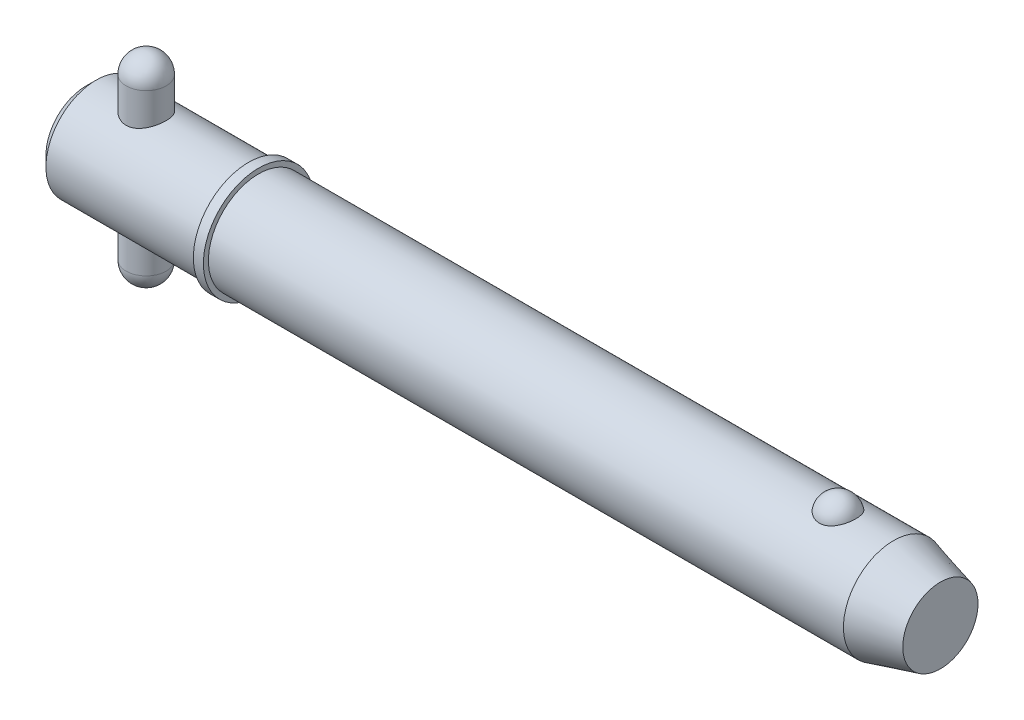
ISO-10303-21;
HEADER;
FILE_DESCRIPTION(('STEP AP214'),'2;1');
FILE_NAME('part.step','',(''),(''),'','','');
FILE_SCHEMA(('AUTOMOTIVE_DESIGN { 1 0 10303 214 1 1 1 1 }'));
ENDSEC;
DATA;
#1=APPLICATION_CONTEXT('core data for automotive mechanical design processes');
#2=APPLICATION_PROTOCOL_DEFINITION('international standard','automotive_design',2000,#1);
#3=PRODUCT_CONTEXT('',#1,'mechanical');
#4=PRODUCT('Part','Part','',(#3));
#5=PRODUCT_RELATED_PRODUCT_CATEGORY('part','',(#4));
#6=PRODUCT_DEFINITION_FORMATION('','',#4);
#7=PRODUCT_DEFINITION_CONTEXT('part definition',#1,'design');
#8=PRODUCT_DEFINITION('design','',#6,#7);
#9=PRODUCT_DEFINITION_SHAPE('','',#8);
#10=(LENGTH_UNIT() NAMED_UNIT(*) SI_UNIT(.MILLI.,.METRE.));
#11=(NAMED_UNIT(*) PLANE_ANGLE_UNIT() SI_UNIT($,.RADIAN.));
#12=(NAMED_UNIT(*) SI_UNIT($,.STERADIAN.) SOLID_ANGLE_UNIT());
#13=UNCERTAINTY_MEASURE_WITH_UNIT(LENGTH_MEASURE(1.E-05),#10,'distance_accuracy_value','');
#14=(GEOMETRIC_REPRESENTATION_CONTEXT(3) GLOBAL_UNCERTAINTY_ASSIGNED_CONTEXT((#13)) GLOBAL_UNIT_ASSIGNED_CONTEXT((#10,
#11,#12)) REPRESENTATION_CONTEXT('',''));
#15=CARTESIAN_POINT('',(0.,0.,0.));
#16=DIRECTION('',(0.,0.,1.));
#17=DIRECTION('',(1.,0.,0.));
#18=AXIS2_PLACEMENT_3D('',#15,#16,#17);
#19=CARTESIAN_POINT('',(9.525,15.875,0.));
#20=DIRECTION('',(0.,-1.,0.));
#21=DIRECTION('',(0.,0.,-1.));
#22=AXIS2_PLACEMENT_3D('',#19,#20,#21);
#23=CYLINDRICAL_SURFACE('',#22,3.175);
#24=CARTESIAN_POINT('',(9.525,-12.7,0.));
#25=DIRECTION('',(0.,-1.,0.));
#26=DIRECTION('',(0.,0.,-1.));
#27=AXIS2_PLACEMENT_3D('',#24,#25,#26);
#28=CIRCLE('',#27,3.175);
#29=CARTESIAN_POINT('',(9.525,-12.7,-3.175));
#30=VERTEX_POINT('',#29);
#31=EDGE_CURVE('P0_E10',#30,#30,#28,.F.);
#32=ORIENTED_EDGE('',*,*,#31,.T.);
#33=EDGE_LOOP('',(#32));
#34=FACE_BOUND('',#33,.T.);
#35=CARTESIAN_POINT('',(9.525,12.7,0.));
#36=DIRECTION('',(0.,-1.,0.));
#37=DIRECTION('',(0.,0.,-1.));
#38=AXIS2_PLACEMENT_3D('',#35,#36,#37);
#39=CIRCLE('',#38,3.175);
#40=CARTESIAN_POINT('',(9.525,12.7,-3.175));
#41=VERTEX_POINT('',#40);
#42=EDGE_CURVE('P0_E21',#41,#41,#39,.T.);
#43=ORIENTED_EDGE('',*,*,#42,.T.);
#44=EDGE_LOOP('',(#43));
#45=FACE_BOUND('',#44,.T.);
#46=ADVANCED_FACE('P0_F14',(#34,#45),#23,.T.);
#47=CARTESIAN_POINT('',(9.525,-12.7,0.));
#48=DIRECTION('',(0.,0.,1.));
#49=DIRECTION('',(1.,0.,0.));
#50=AXIS2_PLACEMENT_3D('',#47,#48,#49);
#51=SPHERICAL_SURFACE('',#50,3.175);
#52=CARTESIAN_POINT('',(9.525,-12.7,0.));
#53=DIRECTION('',(0.,-1.,0.));
#54=DIRECTION('',(0.,0.,-1.));
#55=AXIS2_PLACEMENT_3D('',#52,#53,#54);
#56=SPHERICAL_SURFACE('',#55,3.175);
#57=ORIENTED_EDGE('',*,*,#31,.F.);
#58=EDGE_LOOP('',(#57));
#59=FACE_BOUND('',#58,.T.);
#60=ADVANCED_FACE('P0_F29',(#59),#56,.T.);
#61=CARTESIAN_POINT('',(9.525,12.7,0.));
#62=DIRECTION('',(0.,0.,1.));
#63=DIRECTION('',(1.,0.,0.));
#64=AXIS2_PLACEMENT_3D('',#61,#62,#63);
#65=SPHERICAL_SURFACE('',#64,3.175);
#66=CARTESIAN_POINT('',(9.525,12.7,0.));
#67=DIRECTION('',(0.,-1.,0.));
#68=DIRECTION('',(0.,0.,-1.));
#69=AXIS2_PLACEMENT_3D('',#66,#67,#68);
#70=SPHERICAL_SURFACE('',#69,3.175);
#71=ORIENTED_EDGE('',*,*,#42,.F.);
#72=EDGE_LOOP('',(#71));
#73=FACE_BOUND('',#72,.T.);
#74=ADVANCED_FACE('P0_F16',(#73),#70,.T.);
#75=CLOSED_SHELL('',(#46,#60,#74));
#76=MANIFOLD_SOLID_BREP('P0_B1',#75);
#77=CARTESIAN_POINT('',(0.,0.,0.));
#78=DIRECTION('',(1.,0.,0.));
#79=DIRECTION('',(0.,0.,-1.));
#80=AXIS2_PLACEMENT_3D('',#77,#78,#79);
#81=CYLINDRICAL_SURFACE('',#80,7.94);
#82=CARTESIAN_POINT('',(127.851879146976,0.,0.));
#83=DIRECTION('',(1.,0.,0.));
#84=DIRECTION('',(0.,0.,-1.));
#85=AXIS2_PLACEMENT_3D('',#82,#83,#84);
#86=CIRCLE('',#85,7.94);
#87=CARTESIAN_POINT('',(127.851879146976,0.,-7.94));
#88=VERTEX_POINT('',#87);
#89=EDGE_CURVE('P1_E81',#88,#88,#86,.T.);
#90=ORIENTED_EDGE('',*,*,#89,.F.);
#91=EDGE_LOOP('',(#90));
#92=FACE_BOUND('',#91,.T.);
#93=CARTESIAN_POINT('',(27.31,0.,0.));
#94=DIRECTION('',(1.,0.,0.));
#95=DIRECTION('',(0.,0.,-1.));
#96=AXIS2_PLACEMENT_3D('',#93,#94,#95);
#97=CIRCLE('',#96,7.94);
#98=CARTESIAN_POINT('',(27.31,0.,-7.94));
#99=VERTEX_POINT('',#98);
#100=EDGE_CURVE('P1_E85',#99,#99,#97,.T.);
#101=ORIENTED_EDGE('',*,*,#100,.T.);
#102=EDGE_LOOP('',(#101));
#103=FACE_BOUND('',#102,.T.);
#104=CARTESIAN_POINT('',(119.044907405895,7.37767842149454,2.93486986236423));
#105=CARTESIAN_POINT('',(118.892749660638,7.3776732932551,2.93487505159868));
#106=CARTESIAN_POINT('',(118.740632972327,7.38258419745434,2.92262454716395));
#107=CARTESIAN_POINT('',(118.440928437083,7.40163229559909,2.87404196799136));
#108=CARTESIAN_POINT('',(118.293339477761,7.41576720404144,2.83771585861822));
#109=CARTESIAN_POINT('',(118.007018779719,7.4516157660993,2.74218769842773));
#110=CARTESIAN_POINT('',(117.868274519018,7.47331841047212,2.68301886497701));
#111=CARTESIAN_POINT('',(117.602882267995,7.52194082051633,2.54350967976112));
#112=CARTESIAN_POINT('',(117.476236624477,7.5488615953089,2.46316523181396));
#113=CARTESIAN_POINT('',(117.234534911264,7.60594671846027,2.28090375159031));
#114=CARTESIAN_POINT('',(117.119906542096,7.63618114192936,2.17844211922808));
#115=CARTESIAN_POINT('',(116.908878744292,7.69614046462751,1.95608495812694));
#116=CARTESIAN_POINT('',(116.812482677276,7.72586526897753,1.83618622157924));
#117=CARTESIAN_POINT('',(116.635938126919,7.78314821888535,1.57628086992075));
#118=CARTESIAN_POINT('',(116.556707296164,7.81055035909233,1.43561546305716));
#119=CARTESIAN_POINT('',(116.421797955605,7.85879631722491,1.14236334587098));
#120=CARTESIAN_POINT('',(116.366121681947,7.87963951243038,0.989775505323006));
#121=CARTESIAN_POINT('',(116.27881215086,7.91289645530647,0.67461992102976));
#122=CARTESIAN_POINT('',(116.24753090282,7.925186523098,0.511941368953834));
#123=CARTESIAN_POINT('',(116.210975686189,7.93958930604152,0.183247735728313));
#124=CARTESIAN_POINT('',(116.205701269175,7.94170219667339,0.0172327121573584));
#125=CARTESIAN_POINT('',(116.221231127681,7.93554931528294,-0.312672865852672));
#126=CARTESIAN_POINT('',(116.241925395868,7.92732732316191,-0.4765694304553));
#127=CARTESIAN_POINT('',(116.30878655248,7.90141534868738,-0.79830524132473));
#128=CARTESIAN_POINT('',(116.354953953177,7.88372517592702,-0.956144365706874));
#129=CARTESIAN_POINT('',(116.471898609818,7.84066230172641,-1.26152073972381));
#130=CARTESIAN_POINT('',(116.542704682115,7.81528060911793,-1.40904568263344));
#131=CARTESIAN_POINT('',(116.707478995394,7.7594867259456,-1.68950598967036));
#132=CARTESIAN_POINT('',(116.801448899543,7.72907417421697,-1.82244030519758));
#133=CARTESIAN_POINT('',(117.010839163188,7.66640424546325,-2.07032792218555));
#134=CARTESIAN_POINT('',(117.126315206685,7.63414223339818,-2.1852330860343));
#135=CARTESIAN_POINT('',(117.3759006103,7.57149681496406,-2.39329737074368));
#136=CARTESIAN_POINT('',(117.510008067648,7.54111321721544,-2.48645870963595));
#137=CARTESIAN_POINT('',(117.790111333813,7.48650742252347,-2.64628132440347));
#138=CARTESIAN_POINT('',(117.935760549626,7.46215900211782,-2.71350554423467));
#139=CARTESIAN_POINT('',(118.237425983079,7.42171253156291,-2.82226614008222));
#140=CARTESIAN_POINT('',(118.393438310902,7.40561140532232,-2.86381209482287));
#141=CARTESIAN_POINT('',(118.702970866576,7.3842679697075,-2.9183907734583));
#142=CARTESIAN_POINT('',(118.856222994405,7.37852109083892,-2.93275024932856));
#143=CARTESIAN_POINT('',(119.163070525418,7.37700973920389,-2.93655208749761));
#144=CARTESIAN_POINT('',(119.316665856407,7.38124333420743,-2.92599927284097));
#145=CARTESIAN_POINT('',(119.614990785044,7.39890635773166,-2.88102897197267));
#146=CARTESIAN_POINT('',(119.759848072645,7.41205491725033,-2.84733999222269));
#147=CARTESIAN_POINT('',(120.04164329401,7.445801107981,-2.75788206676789));
#148=CARTESIAN_POINT('',(120.178580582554,7.46639934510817,-2.70211132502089));
#149=CARTESIAN_POINT('',(120.444061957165,7.51339098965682,-2.56858908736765));
#150=CARTESIAN_POINT('',(120.572354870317,7.53990200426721,-2.4903806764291));
#151=CARTESIAN_POINT('',(120.814244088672,7.59569503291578,-2.31462737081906));
#152=CARTESIAN_POINT('',(120.927837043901,7.62497767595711,-2.21707808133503));
#153=CARTESIAN_POINT('',(121.14322156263,7.68489473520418,-1.99982049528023));
#154=CARTESIAN_POINT('',(121.244148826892,7.71552419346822,-1.87925337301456));
#155=CARTESIAN_POINT('',(121.425186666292,7.77353016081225,-1.62268826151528));
#156=CARTESIAN_POINT('',(121.505293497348,7.80090608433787,-1.4866875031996));
#157=CARTESIAN_POINT('',(121.645361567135,7.85047992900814,-1.19818413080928));
#158=CARTESIAN_POINT('',(121.704587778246,7.8724818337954,-1.04529016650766));
#159=CARTESIAN_POINT('',(121.797982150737,7.90785114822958,-0.731080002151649));
#160=CARTESIAN_POINT('',(121.832149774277,7.92121837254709,-0.569763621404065));
#161=CARTESIAN_POINT('',(121.874795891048,7.93797834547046,-0.242812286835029));
#162=CARTESIAN_POINT('',(121.883204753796,7.94134405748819,-0.0771668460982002));
#163=CARTESIAN_POINT('',(121.873962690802,7.93767937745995,0.2532769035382));
#164=CARTESIAN_POINT('',(121.856312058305,7.93064910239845,0.418075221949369));
#165=CARTESIAN_POINT('',(121.795424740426,7.90695571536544,0.74152553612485));
#166=CARTESIAN_POINT('',(121.752281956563,7.8903279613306,0.900197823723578));
#167=CARTESIAN_POINT('',(121.64135358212,7.84916386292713,1.20759654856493));
#168=CARTESIAN_POINT('',(121.57356656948,7.82462706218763,1.35632241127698));
#169=CARTESIAN_POINT('',(121.414371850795,7.7700669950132,1.64032869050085));
#170=CARTESIAN_POINT('',(121.322861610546,7.7400200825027,1.77554712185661));
#171=CARTESIAN_POINT('',(121.118296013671,7.67774175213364,2.02800648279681));
#172=CARTESIAN_POINT('',(121.005241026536,7.64551037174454,2.14524772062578));
#173=CARTESIAN_POINT('',(120.760831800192,7.58265895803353,2.35778002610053));
#174=CARTESIAN_POINT('',(120.629583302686,7.5520309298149,2.45319004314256));
#175=CARTESIAN_POINT('',(120.351601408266,7.49579792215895,2.61999897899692));
#176=CARTESIAN_POINT('',(120.204867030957,7.47019326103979,2.69139637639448));
#177=CARTESIAN_POINT('',(119.892947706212,7.42622216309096,2.8105324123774));
#178=CARTESIAN_POINT('',(119.727220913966,7.40825002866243,2.85700910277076));
#179=CARTESIAN_POINT('',(119.389279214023,7.38398348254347,2.9191685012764));
#180=CARTESIAN_POINT('',(119.21706702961,7.3776842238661,2.93486399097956));
#181=CARTESIAN_POINT('',(119.044907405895,7.37767842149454,2.93486986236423));
#182=B_SPLINE_CURVE_WITH_KNOTS('',3,(#104,#105,#106,#107,#108,#109,#110,#111,#112,#113,#114,
#115,#116,#117,#118,#119,#120,#121,#122,#123,#124,#125,#126,#127,#128,#129,#130,#131,#132,#133,
#134,#135,#136,#137,#138,#139,#140,#141,#142,#143,#144,#145,#146,#147,#148,#149,#150,#151,#152,
#153,#154,#155,#156,#157,#158,#159,#160,#161,#162,#163,#164,#165,#166,#167,#168,#169,#170,#171,
#172,#173,#174,#175,#176,#177,#178,#179,#180,#181),.UNSPECIFIED.,.T.,.F.,(4,2,2,2,2,2,2,2,2,2,2,
2,2,2,2,2,2,2,2,2,2,2,2,2,2,2,2,2,2,2,2,2,2,2,2,2,2,2,4),(0.,0.45584132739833,0.911569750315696,
1.36663794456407,1.8217942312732,2.28978983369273,2.7578716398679,3.246853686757,
3.73588214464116,4.23184282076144,4.72779494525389,5.22165321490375,5.71552141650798,
6.20996917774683,6.70445245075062,7.20023431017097,7.69596557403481,8.18023418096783,
8.66432203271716,9.12410697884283,9.58380291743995,10.0296503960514,10.4755341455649,
10.9312349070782,11.3870393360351,11.8654416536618,12.3439299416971,12.8378875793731,
13.3318558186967,13.8271581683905,14.3224549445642,14.8159385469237,15.3094506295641,
15.8051323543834,16.3008055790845,16.7937101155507,17.2866458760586,17.8026240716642,
18.3183879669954),.UNSPECIFIED.);
#183=CARTESIAN_POINT('',(119.044907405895,7.37767842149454,2.93486986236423));
#184=VERTEX_POINT('',#183);
#185=EDGE_CURVE('P1_E35',#184,#184,#182,.T.);
#186=ORIENTED_EDGE('',*,*,#185,.T.);
#187=EDGE_LOOP('',(#186));
#188=FACE_BOUND('',#187,.T.);
#189=ADVANCED_FACE('P1_F13',(#92,#103,#188),#81,.T.);
#190=CARTESIAN_POINT('',(0.,0.,0.));
#191=DIRECTION('',(-1.,0.,0.));
#192=DIRECTION('',(0.,0.,1.));
#193=AXIS2_PLACEMENT_3D('',#190,#191,#192);
#194=PLANE('',#193);
#195=CARTESIAN_POINT('',(0.,0.,0.));
#196=DIRECTION('',(1.,0.,0.));
#197=DIRECTION('',(0.,0.,-1.));
#198=AXIS2_PLACEMENT_3D('',#195,#196,#197);
#199=CIRCLE('',#198,6.352);
#200=CARTESIAN_POINT('',(0.,0.,-6.352));
#201=VERTEX_POINT('',#200);
#202=EDGE_CURVE('P1_E9',#201,#201,#199,.T.);
#203=ORIENTED_EDGE('',*,*,#202,.F.);
#204=EDGE_LOOP('',(#203));
#205=FACE_BOUND('',#204,.T.);
#206=ADVANCED_FACE('P1_F15',(#205),#194,.T.);
#207=CARTESIAN_POINT('',(1.58799999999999,0.,0.));
#208=DIRECTION('',(1.,0.,0.));
#209=DIRECTION('',(0.,0.,-1.));
#210=AXIS2_PLACEMENT_3D('',#207,#208,#209);
#211=CONICAL_SURFACE('',#210,7.94,0.78539816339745);
#212=ORIENTED_EDGE('',*,*,#202,.T.);
#213=EDGE_LOOP('',(#212));
#214=FACE_BOUND('',#213,.T.);
#215=CARTESIAN_POINT('',(1.58799999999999,0.,0.));
#216=DIRECTION('',(1.,0.,0.));
#217=DIRECTION('',(0.,0.,-1.));
#218=AXIS2_PLACEMENT_3D('',#215,#216,#217);
#219=CIRCLE('',#218,7.94);
#220=CARTESIAN_POINT('',(1.58799999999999,0.,-7.94));
#221=VERTEX_POINT('',#220);
#222=EDGE_CURVE('P1_E26',#221,#221,#219,.T.);
#223=ORIENTED_EDGE('',*,*,#222,.F.);
#224=EDGE_LOOP('',(#223));
#225=FACE_BOUND('',#224,.T.);
#226=ADVANCED_FACE('P1_F77',(#214,#225),#211,.T.);
#227=CARTESIAN_POINT('',(0.,0.,0.));
#228=DIRECTION('',(1.,0.,0.));
#229=DIRECTION('',(0.,0.,-1.));
#230=AXIS2_PLACEMENT_3D('',#227,#228,#229);
#231=CYLINDRICAL_SURFACE('',#230,7.94);
#232=CARTESIAN_POINT('',(9.525,-7.27756655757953,3.175));
#233=CARTESIAN_POINT('',(9.43992346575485,-7.27756715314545,3.17499935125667));
#234=CARTESIAN_POINT('',(9.35481882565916,-7.27906496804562,3.1715736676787));
#235=CARTESIAN_POINT('',(9.18524505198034,-7.28499816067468,3.15791803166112));
#236=CARTESIAN_POINT('',(9.100776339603,-7.28943533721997,3.14768391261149));
#237=CARTESIAN_POINT('',(8.84895715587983,-7.30698881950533,3.10684226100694));
#238=CARTESIAN_POINT('',(8.6834173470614,-7.32434654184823,3.06609574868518));
#239=CARTESIAN_POINT('',(8.36278910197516,-7.36806950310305,2.95945910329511));
#240=CARTESIAN_POINT('',(8.20766386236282,-7.39440078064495,2.89366366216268));
#241=CARTESIAN_POINT('',(7.91065319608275,-7.45304562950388,2.73907413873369));
#242=CARTESIAN_POINT('',(7.76876488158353,-7.48535789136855,2.65028508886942));
#243=CARTESIAN_POINT('',(7.49411086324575,-7.55439482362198,2.44679888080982));
#244=CARTESIAN_POINT('',(7.36219910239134,-7.59126138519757,2.33099745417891));
#245=CARTESIAN_POINT('',(7.11904234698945,-7.66408045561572,2.07909838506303));
#246=CARTESIAN_POINT('',(7.00780457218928,-7.70003264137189,1.94299368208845));
#247=CARTESIAN_POINT('',(6.80492173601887,-7.76867514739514,1.64775981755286));
#248=CARTESIAN_POINT('',(6.71422139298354,-7.80118112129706,1.48793473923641));
#249=CARTESIAN_POINT('',(6.56135788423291,-7.85754918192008,1.15376269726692));
#250=CARTESIAN_POINT('',(6.49918311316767,-7.88141478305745,0.979421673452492));
#251=CARTESIAN_POINT('',(6.40818142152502,-7.91680873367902,0.630115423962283));
#252=CARTESIAN_POINT('',(6.3778864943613,-7.9288781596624,0.455588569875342));
#253=CARTESIAN_POINT('',(6.34677743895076,-7.94127547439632,0.103539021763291));
#254=CARTESIAN_POINT('',(6.34595232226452,-7.94160773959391,-0.0739825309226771));
#255=CARTESIAN_POINT('',(6.37300128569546,-7.93082261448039,-0.416371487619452));
#256=CARTESIAN_POINT('',(6.39926693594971,-7.92034690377,-0.581389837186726));
#257=CARTESIAN_POINT('',(6.47701615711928,-7.88998770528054,-0.904449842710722));
#258=CARTESIAN_POINT('',(6.52850157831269,-7.87010352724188,-1.06249098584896));
#259=CARTESIAN_POINT('',(6.65586120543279,-7.82249343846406,-1.36995769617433));
#260=CARTESIAN_POINT('',(6.73209124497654,-7.79465387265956,-1.51921754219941));
#261=CARTESIAN_POINT('',(6.90644286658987,-7.73389606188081,-1.80321183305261));
#262=CARTESIAN_POINT('',(7.00457194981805,-7.70097607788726,-1.93794127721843));
#263=CARTESIAN_POINT('',(7.22744086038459,-7.63084889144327,-2.19843606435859));
#264=CARTESIAN_POINT('',(7.35350432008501,-7.59350211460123,-2.3230330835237));
#265=CARTESIAN_POINT('',(7.62488266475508,-7.52039654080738,-2.54979642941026));
#266=CARTESIAN_POINT('',(7.77020381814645,-7.48463826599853,-2.65195542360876));
#267=CARTESIAN_POINT('',(8.08119298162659,-7.41780943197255,-2.83361305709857));
#268=CARTESIAN_POINT('',(8.24731937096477,-7.38689959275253,-2.91239105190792));
#269=CARTESIAN_POINT('',(8.59204539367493,-7.33515216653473,-3.04038913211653));
#270=CARTESIAN_POINT('',(8.77063684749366,-7.31430804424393,-3.08962840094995));
#271=CARTESIAN_POINT('',(9.12356982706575,-7.28663831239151,-3.15431018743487));
#272=CARTESIAN_POINT('',(9.29750494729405,-7.2790344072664,-3.17163284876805));
#273=CARTESIAN_POINT('',(9.64592502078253,-7.27648884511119,-3.17747282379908));
#274=CARTESIAN_POINT('',(9.82040979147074,-7.28154335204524,-3.16599886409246));
#275=CARTESIAN_POINT('',(10.1545374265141,-7.30294638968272,-3.11628310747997));
#276=CARTESIAN_POINT('',(10.3144598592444,-7.31863587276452,-3.0796016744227));
#277=CARTESIAN_POINT('',(10.625774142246,-7.35872371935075,-2.98253618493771));
#278=CARTESIAN_POINT('',(10.7771640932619,-7.38312401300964,-2.92214687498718));
#279=CARTESIAN_POINT('',(11.0739599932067,-7.4390944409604,-2.77664664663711));
#280=CARTESIAN_POINT('',(11.2188745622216,-7.47091513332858,-2.69063278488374));
#281=CARTESIAN_POINT('',(11.4928722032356,-7.53775867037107,-2.49724834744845));
#282=CARTESIAN_POINT('',(11.6219487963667,-7.57278281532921,-2.38986907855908));
#283=CARTESIAN_POINT('',(11.8705091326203,-7.64520845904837,-2.1474449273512));
#284=CARTESIAN_POINT('',(11.9885816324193,-7.68259462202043,-2.01094304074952));
#285=CARTESIAN_POINT('',(12.2003631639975,-7.75309951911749,-1.71917041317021));
#286=CARTESIAN_POINT('',(12.2940712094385,-7.78621808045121,-1.56389891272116));
#287=CARTESIAN_POINT('',(12.4541161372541,-7.84456050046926,-1.23845027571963));
#288=CARTESIAN_POINT('',(12.5204600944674,-7.86978639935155,-1.06827700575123));
#289=CARTESIAN_POINT('',(12.6231407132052,-7.90943635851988,-0.717928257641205));
#290=CARTESIAN_POINT('',(12.6594936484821,-7.92386627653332,-0.537758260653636));
#291=CARTESIAN_POINT('',(12.6992281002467,-7.93967263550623,-0.185201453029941));
#292=CARTESIAN_POINT('',(12.7046050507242,-7.94183891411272,-0.0130732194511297));
#293=CARTESIAN_POINT('',(12.6875036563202,-7.9350072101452,0.329549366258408));
#294=CARTESIAN_POINT('',(12.6650295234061,-7.92601091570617,0.500043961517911));
#295=CARTESIAN_POINT('',(12.5942896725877,-7.89825976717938,0.829196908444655));
#296=CARTESIAN_POINT('',(12.5468364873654,-7.87981280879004,0.988057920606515));
#297=CARTESIAN_POINT('',(12.4283390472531,-7.83513565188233,1.29553461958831));
#298=CARTESIAN_POINT('',(12.3572904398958,-7.8089040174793,1.44414841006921));
#299=CARTESIAN_POINT('',(12.1900822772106,-7.7497911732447,1.73412879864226));
#300=CARTESIAN_POINT('',(12.0929519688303,-7.71666737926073,1.87488510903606));
#301=CARTESIAN_POINT('',(11.8777894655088,-7.64775894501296,2.13869231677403));
#302=CARTESIAN_POINT('',(11.7597486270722,-7.61197320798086,2.26173585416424));
#303=CARTESIAN_POINT('',(11.4974896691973,-7.53902341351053,2.49449755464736));
#304=CARTESIAN_POINT('',(11.3521039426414,-7.50191102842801,2.60292060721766));
#305=CARTESIAN_POINT('',(11.0440201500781,-7.43289551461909,2.79392602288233));
#306=CARTESIAN_POINT('',(10.8813200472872,-7.40099299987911,2.87650534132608));
#307=CARTESIAN_POINT('',(10.558064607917,-7.3489506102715,3.00682739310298));
#308=CARTESIAN_POINT('',(10.398627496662,-7.32801197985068,3.05703164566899));
#309=CARTESIAN_POINT('',(10.0731242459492,-7.29639491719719,3.13175843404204));
#310=CARTESIAN_POINT('',(9.90707793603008,-7.28568789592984,3.15635254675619));
#311=CARTESIAN_POINT('',(9.70441566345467,-7.27968826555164,3.17013149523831));
#312=CARTESIAN_POINT('',(9.66856669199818,-7.27889378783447,3.17195593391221));
#313=CARTESIAN_POINT('',(9.59681348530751,-7.27783278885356,3.17439036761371));
#314=CARTESIAN_POINT('',(9.56090924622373,-7.27756630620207,3.17500027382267));
#315=CARTESIAN_POINT('',(9.525,-7.27756655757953,3.175));
#316=B_SPLINE_CURVE_WITH_KNOTS('',3,(#232,#233,#234,#235,#236,#237,#238,#239,#240,#241,#242,
#243,#244,#245,#246,#247,#248,#249,#250,#251,#252,#253,#254,#255,#256,#257,#258,#259,#260,#261,
#262,#263,#264,#265,#266,#267,#268,#269,#270,#271,#272,#273,#274,#275,#276,#277,#278,#279,#280,
#281,#282,#283,#284,#285,#286,#287,#288,#289,#290,#291,#292,#293,#294,#295,#296,#297,#298,#299,
#300,#301,#302,#303,#304,#305,#306,#307,#308,#309,#310,#311,#312,#313,#314,#315),.UNSPECIFIED.,
.T.,.F.,(4,2,2,2,2,2,2,2,2,2,2,2,2,2,2,2,2,2,2,2,2,2,2,2,2,2,2,2,2,2,2,2,2,2,2,2,2,2,2,2,2,4),
(0.,0.255187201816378,0.510530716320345,1.0218798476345,1.53131482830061,2.04063840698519,
2.57635929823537,3.11226692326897,3.66929090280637,4.22608806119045,4.75594400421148,
5.28560237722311,5.78552836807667,6.28549104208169,6.79298787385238,7.30065880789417,
7.8416422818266,8.38280228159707,8.93923025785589,9.49529647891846,10.0174074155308,
10.5393601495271,11.0316114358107,11.5239718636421,12.0362920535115,12.5488211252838,
13.0991799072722,13.6495609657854,14.1997996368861,14.7497395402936,15.2638187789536,
15.7778202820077,16.2760504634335,16.7743726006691,17.294711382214,17.8152657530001,
18.3680208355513,18.9208410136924,19.4240423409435,19.9258334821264,20.0335354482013,
20.1412452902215),.UNSPECIFIED.);
#317=CARTESIAN_POINT('',(9.525,-7.27756655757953,3.175));
#318=VERTEX_POINT('',#317);
#319=EDGE_CURVE('P1_E17',#318,#318,#316,.T.);
#320=ORIENTED_EDGE('',*,*,#319,.F.);
#321=EDGE_LOOP('',(#320));
#322=FACE_BOUND('',#321,.T.);
#323=CARTESIAN_POINT('',(9.525,7.27756655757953,3.175));
#324=CARTESIAN_POINT('',(9.61007653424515,7.27756715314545,3.17499935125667));
#325=CARTESIAN_POINT('',(9.69518117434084,7.27906496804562,3.1715736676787));
#326=CARTESIAN_POINT('',(9.86475494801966,7.28499816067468,3.15791803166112));
#327=CARTESIAN_POINT('',(9.949223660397,7.28943533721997,3.14768391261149));
#328=CARTESIAN_POINT('',(10.2010428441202,7.30698881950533,3.10684226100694));
#329=CARTESIAN_POINT('',(10.3665826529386,7.32434654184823,3.06609574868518));
#330=CARTESIAN_POINT('',(10.6872108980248,7.36806950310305,2.95945910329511));
#331=CARTESIAN_POINT('',(10.8423361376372,7.39440078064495,2.89366366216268));
#332=CARTESIAN_POINT('',(11.1393468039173,7.45304562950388,2.73907413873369));
#333=CARTESIAN_POINT('',(11.2812351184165,7.48535789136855,2.65028508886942));
#334=CARTESIAN_POINT('',(11.5558891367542,7.55439482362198,2.44679888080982));
#335=CARTESIAN_POINT('',(11.6878008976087,7.59126138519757,2.33099745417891));
#336=CARTESIAN_POINT('',(11.9309576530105,7.66408045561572,2.07909838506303));
#337=CARTESIAN_POINT('',(12.0421954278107,7.70003264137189,1.94299368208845));
#338=CARTESIAN_POINT('',(12.2450782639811,7.76867514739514,1.64775981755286));
#339=CARTESIAN_POINT('',(12.3357786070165,7.80118112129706,1.48793473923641));
#340=CARTESIAN_POINT('',(12.4886421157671,7.85754918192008,1.15376269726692));
#341=CARTESIAN_POINT('',(12.5508168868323,7.88141478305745,0.979421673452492));
#342=CARTESIAN_POINT('',(12.641818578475,7.91680873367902,0.630115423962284));
#343=CARTESIAN_POINT('',(12.6721135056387,7.9288781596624,0.455588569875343));
#344=CARTESIAN_POINT('',(12.7032225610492,7.94127547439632,0.103539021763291));
#345=CARTESIAN_POINT('',(12.7040476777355,7.94160773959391,-0.0739825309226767));
#346=CARTESIAN_POINT('',(12.6769987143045,7.93082261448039,-0.416371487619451));
#347=CARTESIAN_POINT('',(12.6507330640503,7.92034690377,-0.581389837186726));
#348=CARTESIAN_POINT('',(12.5729838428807,7.88998770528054,-0.904449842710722));
#349=CARTESIAN_POINT('',(12.5214984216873,7.87010352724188,-1.06249098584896));
#350=CARTESIAN_POINT('',(12.3941387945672,7.82249343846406,-1.36995769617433));
#351=CARTESIAN_POINT('',(12.3179087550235,7.79465387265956,-1.51921754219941));
#352=CARTESIAN_POINT('',(12.1435571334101,7.73389606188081,-1.80321183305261));
#353=CARTESIAN_POINT('',(12.0454280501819,7.70097607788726,-1.93794127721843));
#354=CARTESIAN_POINT('',(11.8225591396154,7.63084889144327,-2.19843606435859));
#355=CARTESIAN_POINT('',(11.696495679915,7.59350211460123,-2.3230330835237));
#356=CARTESIAN_POINT('',(11.4251173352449,7.52039654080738,-2.54979642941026));
#357=CARTESIAN_POINT('',(11.2797961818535,7.48463826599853,-2.65195542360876));
#358=CARTESIAN_POINT('',(10.9688070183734,7.41780943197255,-2.83361305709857));
#359=CARTESIAN_POINT('',(10.8026806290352,7.38689959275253,-2.91239105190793));
#360=CARTESIAN_POINT('',(10.4579546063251,7.33515216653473,-3.04038913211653));
#361=CARTESIAN_POINT('',(10.2793631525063,7.31430804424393,-3.08962840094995));
#362=CARTESIAN_POINT('',(9.92643017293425,7.28663831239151,-3.15431018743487));
#363=CARTESIAN_POINT('',(9.75249505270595,7.2790344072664,-3.17163284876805));
#364=CARTESIAN_POINT('',(9.40407497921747,7.2764888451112,-3.17747282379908));
#365=CARTESIAN_POINT('',(9.22959020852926,7.28154335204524,-3.16599886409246));
#366=CARTESIAN_POINT('',(8.89546257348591,7.30294638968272,-3.11628310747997));
#367=CARTESIAN_POINT('',(8.73554014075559,7.31863587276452,-3.0796016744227));
#368=CARTESIAN_POINT('',(8.42422585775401,7.35872371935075,-2.98253618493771));
#369=CARTESIAN_POINT('',(8.27283590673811,7.38312401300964,-2.92214687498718));
#370=CARTESIAN_POINT('',(7.97604000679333,7.4390944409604,-2.77664664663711));
#371=CARTESIAN_POINT('',(7.83112543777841,7.47091513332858,-2.69063278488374));
#372=CARTESIAN_POINT('',(7.55712779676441,7.53775867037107,-2.49724834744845));
#373=CARTESIAN_POINT('',(7.42805120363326,7.57278281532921,-2.38986907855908));
#374=CARTESIAN_POINT('',(7.17949086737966,7.64520845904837,-2.1474449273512));
#375=CARTESIAN_POINT('',(7.06141836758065,7.68259462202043,-2.01094304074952));
#376=CARTESIAN_POINT('',(6.8496368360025,7.75309951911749,-1.71917041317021));
#377=CARTESIAN_POINT('',(6.75592879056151,7.78621808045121,-1.56389891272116));
#378=CARTESIAN_POINT('',(6.59588386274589,7.84456050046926,-1.23845027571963));
#379=CARTESIAN_POINT('',(6.52953990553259,7.86978639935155,-1.06827700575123));
#380=CARTESIAN_POINT('',(6.42685928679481,7.90943635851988,-0.717928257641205));
#381=CARTESIAN_POINT('',(6.39050635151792,7.92386627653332,-0.537758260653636));
#382=CARTESIAN_POINT('',(6.35077189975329,7.93967263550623,-0.18520145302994));
#383=CARTESIAN_POINT('',(6.34539494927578,7.94183891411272,-0.0130732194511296));
#384=CARTESIAN_POINT('',(6.36249634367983,7.9350072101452,0.329549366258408));
#385=CARTESIAN_POINT('',(6.38497047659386,7.92601091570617,0.500043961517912));
#386=CARTESIAN_POINT('',(6.45571032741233,7.89825976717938,0.829196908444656));
#387=CARTESIAN_POINT('',(6.50316351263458,7.87981280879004,0.988057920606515));
#388=CARTESIAN_POINT('',(6.62166095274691,7.83513565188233,1.29553461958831));
#389=CARTESIAN_POINT('',(6.69270956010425,7.8089040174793,1.44414841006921));
#390=CARTESIAN_POINT('',(6.85991772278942,7.7497911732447,1.73412879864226));
#391=CARTESIAN_POINT('',(6.95704803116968,7.71666737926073,1.87488510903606));
#392=CARTESIAN_POINT('',(7.17221053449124,7.64775894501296,2.13869231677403));
#393=CARTESIAN_POINT('',(7.29025137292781,7.61197320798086,2.26173585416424));
#394=CARTESIAN_POINT('',(7.55251033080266,7.53902341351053,2.49449755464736));
#395=CARTESIAN_POINT('',(7.69789605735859,7.50191102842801,2.60292060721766));
#396=CARTESIAN_POINT('',(8.00597984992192,7.43289551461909,2.79392602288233));
#397=CARTESIAN_POINT('',(8.16867995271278,7.40099299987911,2.87650534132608));
#398=CARTESIAN_POINT('',(8.49193539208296,7.3489506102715,3.00682739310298));
#399=CARTESIAN_POINT('',(8.65137250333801,7.32801197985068,3.05703164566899));
#400=CARTESIAN_POINT('',(8.97687575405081,7.29639491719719,3.13175843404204));
#401=CARTESIAN_POINT('',(9.14292206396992,7.28568789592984,3.15635254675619));
#402=CARTESIAN_POINT('',(9.34558433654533,7.27968826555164,3.17013149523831));
#403=CARTESIAN_POINT('',(9.38143330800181,7.27889378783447,3.17195593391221));
#404=CARTESIAN_POINT('',(9.45318651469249,7.27783278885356,3.17439036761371));
#405=CARTESIAN_POINT('',(9.48909075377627,7.27756630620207,3.17500027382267));
#406=CARTESIAN_POINT('',(9.525,7.27756655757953,3.175));
#407=B_SPLINE_CURVE_WITH_KNOTS('',3,(#323,#324,#325,#326,#327,#328,#329,#330,#331,#332,#333,
#334,#335,#336,#337,#338,#339,#340,#341,#342,#343,#344,#345,#346,#347,#348,#349,#350,#351,#352,
#353,#354,#355,#356,#357,#358,#359,#360,#361,#362,#363,#364,#365,#366,#367,#368,#369,#370,#371,
#372,#373,#374,#375,#376,#377,#378,#379,#380,#381,#382,#383,#384,#385,#386,#387,#388,#389,#390,
#391,#392,#393,#394,#395,#396,#397,#398,#399,#400,#401,#402,#403,#404,#405,#406),.UNSPECIFIED.,
.T.,.F.,(4,2,2,2,2,2,2,2,2,2,2,2,2,2,2,2,2,2,2,2,2,2,2,2,2,2,2,2,2,2,2,2,2,2,2,2,2,2,2,2,2,4),
(0.,0.255187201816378,0.510530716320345,1.0218798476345,1.53131482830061,2.04063840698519,
2.57635929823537,3.11226692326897,3.66929090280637,4.22608806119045,4.75594400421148,
5.2856023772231,5.78552836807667,6.28549104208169,6.79298787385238,7.30065880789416,
7.8416422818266,8.38280228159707,8.9392302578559,9.49529647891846,10.0174074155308,
10.5393601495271,11.0316114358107,11.5239718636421,12.0362920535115,12.5488211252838,
13.0991799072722,13.6495609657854,14.1997996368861,14.7497395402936,15.2638187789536,
15.7778202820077,16.2760504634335,16.7743726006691,17.294711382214,17.8152657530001,
18.3680208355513,18.9208410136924,19.4240423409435,19.9258334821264,20.0335354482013,
20.1412452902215),.UNSPECIFIED.);
#408=CARTESIAN_POINT('',(9.525,7.27756655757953,3.175));
#409=VERTEX_POINT('',#408);
#410=EDGE_CURVE('P1_E43',#409,#409,#407,.T.);
#411=ORIENTED_EDGE('',*,*,#410,.F.);
#412=EDGE_LOOP('',(#411));
#413=FACE_BOUND('',#412,.T.);
#414=ORIENTED_EDGE('',*,*,#222,.T.);
#415=EDGE_LOOP('',(#414));
#416=FACE_BOUND('',#415,.T.);
#417=CARTESIAN_POINT('',(25.722,0.,0.));
#418=DIRECTION('',(1.,0.,0.));
#419=DIRECTION('',(0.,0.,-1.));
#420=AXIS2_PLACEMENT_3D('',#417,#418,#419);
#421=CIRCLE('',#420,7.94);
#422=CARTESIAN_POINT('',(25.722,0.,-7.94));
#423=VERTEX_POINT('',#422);
#424=EDGE_CURVE('P1_E31',#423,#423,#421,.T.);
#425=ORIENTED_EDGE('',*,*,#424,.F.);
#426=EDGE_LOOP('',(#425));
#427=FACE_BOUND('',#426,.T.);
#428=ADVANCED_FACE('P1_F103',(#322,#413,#416,#427),#231,.T.);
#429=CARTESIAN_POINT('',(25.722,7.94,0.));
#430=DIRECTION('',(-1.,0.,0.));
#431=DIRECTION('',(0.,0.,1.));
#432=AXIS2_PLACEMENT_3D('',#429,#430,#431);
#433=PLANE('',#432);
#434=ORIENTED_EDGE('',*,*,#424,.T.);
#435=EDGE_LOOP('',(#434));
#436=FACE_BOUND('',#435,.T.);
#437=CARTESIAN_POINT('',(25.722,0.,0.));
#438=DIRECTION('',(1.,0.,0.));
#439=DIRECTION('',(0.,0.,-1.));
#440=AXIS2_PLACEMENT_3D('',#437,#438,#439);
#441=CIRCLE('',#440,8.734);
#442=CARTESIAN_POINT('',(25.722,0.,-8.734));
#443=VERTEX_POINT('',#442);
#444=EDGE_CURVE('P1_E91',#443,#443,#441,.T.);
#445=ORIENTED_EDGE('',*,*,#444,.F.);
#446=EDGE_LOOP('',(#445));
#447=FACE_BOUND('',#446,.T.);
#448=ADVANCED_FACE('P1_F100',(#436,#447),#433,.T.);
#449=CARTESIAN_POINT('',(0.,0.,0.));
#450=DIRECTION('',(1.,0.,0.));
#451=DIRECTION('',(0.,0.,-1.));
#452=AXIS2_PLACEMENT_3D('',#449,#450,#451);
#453=CYLINDRICAL_SURFACE('',#452,8.734);
#454=ORIENTED_EDGE('',*,*,#444,.T.);
#455=EDGE_LOOP('',(#454));
#456=FACE_BOUND('',#455,.T.);
#457=CARTESIAN_POINT('',(27.31,0.,0.));
#458=DIRECTION('',(1.,0.,0.));
#459=DIRECTION('',(0.,0.,-1.));
#460=AXIS2_PLACEMENT_3D('',#457,#458,#459);
#461=CIRCLE('',#460,8.734);
#462=CARTESIAN_POINT('',(27.31,0.,-8.734));
#463=VERTEX_POINT('',#462);
#464=EDGE_CURVE('P1_E88',#463,#463,#461,.T.);
#465=ORIENTED_EDGE('',*,*,#464,.F.);
#466=EDGE_LOOP('',(#465));
#467=FACE_BOUND('',#466,.T.);
#468=ADVANCED_FACE('P1_F68',(#456,#467),#453,.T.);
#469=CARTESIAN_POINT('',(27.31,8.734,0.));
#470=DIRECTION('',(1.,0.,0.));
#471=DIRECTION('',(0.,0.,-1.));
#472=AXIS2_PLACEMENT_3D('',#469,#470,#471);
#473=PLANE('',#472);
#474=ORIENTED_EDGE('',*,*,#464,.T.);
#475=EDGE_LOOP('',(#474));
#476=FACE_BOUND('',#475,.T.);
#477=ORIENTED_EDGE('',*,*,#100,.F.);
#478=EDGE_LOOP('',(#477));
#479=FACE_BOUND('',#478,.T.);
#480=ADVANCED_FACE('P1_F62',(#476,#479),#473,.T.);
#481=CARTESIAN_POINT('',(135.26,0.,0.));
#482=DIRECTION('',(-1.,0.,0.));
#483=DIRECTION('',(0.,0.,1.));
#484=AXIS2_PLACEMENT_3D('',#481,#482,#483);
#485=CONICAL_SURFACE('',#484,5.95500000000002,0.261799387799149);
#486=ORIENTED_EDGE('',*,*,#89,.T.);
#487=EDGE_LOOP('',(#486));
#488=FACE_BOUND('',#487,.T.);
#489=CARTESIAN_POINT('',(135.26,0.,0.));
#490=DIRECTION('',(1.,0.,0.));
#491=DIRECTION('',(0.,0.,-1.));
#492=AXIS2_PLACEMENT_3D('',#489,#490,#491);
#493=CIRCLE('',#492,5.95500000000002);
#494=CARTESIAN_POINT('',(135.26,0.,-5.95500000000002));
#495=VERTEX_POINT('',#494);
#496=EDGE_CURVE('P1_E42',#495,#495,#493,.T.);
#497=ORIENTED_EDGE('',*,*,#496,.F.);
#498=EDGE_LOOP('',(#497));
#499=FACE_BOUND('',#498,.T.);
#500=ADVANCED_FACE('P1_F59',(#488,#499),#485,.T.);
#501=CARTESIAN_POINT('',(135.26,5.95500000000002,0.));
#502=DIRECTION('',(1.,0.,0.));
#503=DIRECTION('',(0.,0.,-1.));
#504=AXIS2_PLACEMENT_3D('',#501,#502,#503);
#505=PLANE('',#504);
#506=ORIENTED_EDGE('',*,*,#496,.T.);
#507=EDGE_LOOP('',(#506));
#508=FACE_BOUND('',#507,.T.);
#509=ADVANCED_FACE('P1_F55',(#508),#505,.T.);
#510=CARTESIAN_POINT('',(119.044907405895,7.146,0.));
#511=DIRECTION('',(-1.,0.,0.));
#512=DIRECTION('',(0.,1.,0.));
#513=AXIS2_PLACEMENT_3D('',#510,#511,#512);
#514=SPHERICAL_SURFACE('',#513,2.944);
#515=ORIENTED_EDGE('',*,*,#185,.F.);
#516=EDGE_LOOP('',(#515));
#517=FACE_BOUND('',#516,.T.);
#518=ADVANCED_FACE('P1_F50',(#517),#514,.T.);
#519=CARTESIAN_POINT('',(9.525,-8.734,0.));
#520=DIRECTION('',(0.,1.,0.));
#521=DIRECTION('',(0.,0.,1.));
#522=AXIS2_PLACEMENT_3D('',#519,#520,#521);
#523=CYLINDRICAL_SURFACE('',#522,3.175);
#524=ORIENTED_EDGE('',*,*,#319,.T.);
#525=EDGE_LOOP('',(#524));
#526=FACE_BOUND('',#525,.T.);
#527=ORIENTED_EDGE('',*,*,#410,.T.);
#528=EDGE_LOOP('',(#527));
#529=FACE_BOUND('',#528,.T.);
#530=ADVANCED_FACE('P1_F54',(#526,#529),#523,.F.);
#531=CLOSED_SHELL('',(#189,#206,#226,#428,#448,#468,#480,#500,#509,#518,#530));
#532=MANIFOLD_SOLID_BREP('P1_B1',#531);
#533=ADVANCED_BREP_SHAPE_REPRESENTATION('',(#18,#76,#532),#14);
#534=SHAPE_DEFINITION_REPRESENTATION(#9,#533);
ENDSEC;
END-ISO-10303-21;
